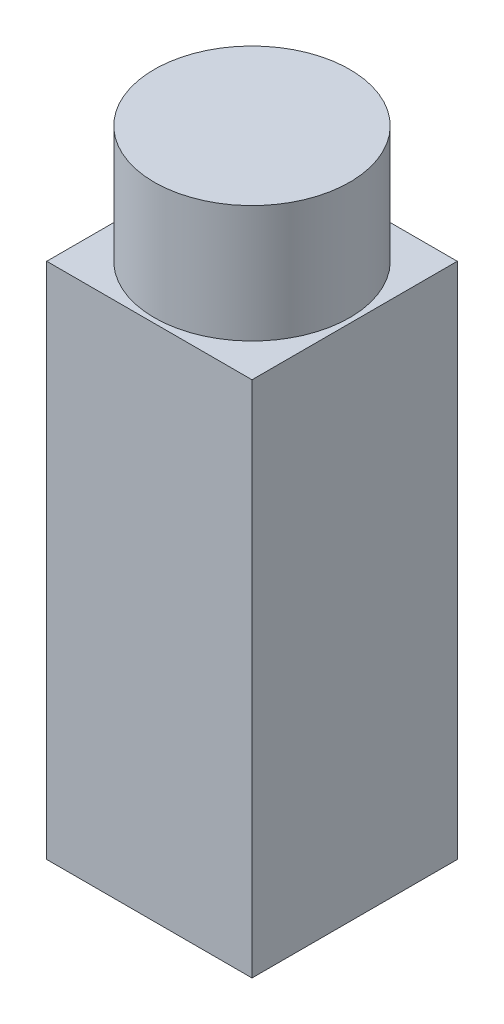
ISO-10303-21;
HEADER;
FILE_DESCRIPTION(('STEP AP214'),'2;1');
FILE_NAME('part.step','',(''),(''),'','','');
FILE_SCHEMA(('AUTOMOTIVE_DESIGN { 1 0 10303 214 1 1 1 1 }'));
ENDSEC;
DATA;
#1=APPLICATION_CONTEXT('core data for automotive mechanical design processes');
#2=APPLICATION_PROTOCOL_DEFINITION('international standard','automotive_design',2000,#1);
#3=PRODUCT_CONTEXT('',#1,'mechanical');
#4=PRODUCT('Part','Part','',(#3));
#5=PRODUCT_RELATED_PRODUCT_CATEGORY('part','',(#4));
#6=PRODUCT_DEFINITION_FORMATION('','',#4);
#7=PRODUCT_DEFINITION_CONTEXT('part definition',#1,'design');
#8=PRODUCT_DEFINITION('design','',#6,#7);
#9=PRODUCT_DEFINITION_SHAPE('','',#8);
#10=(LENGTH_UNIT() NAMED_UNIT(*) SI_UNIT(.MILLI.,.METRE.));
#11=(NAMED_UNIT(*) PLANE_ANGLE_UNIT() SI_UNIT($,.RADIAN.));
#12=(NAMED_UNIT(*) SI_UNIT($,.STERADIAN.) SOLID_ANGLE_UNIT());
#13=UNCERTAINTY_MEASURE_WITH_UNIT(LENGTH_MEASURE(1.E-05),#10,'distance_accuracy_value','');
#14=(GEOMETRIC_REPRESENTATION_CONTEXT(3) GLOBAL_UNCERTAINTY_ASSIGNED_CONTEXT((#13)) GLOBAL_UNIT_ASSIGNED_CONTEXT((#10,
#11,#12)) REPRESENTATION_CONTEXT('',''));
#15=CARTESIAN_POINT('',(0.,0.,0.));
#16=DIRECTION('',(0.,0.,1.));
#17=DIRECTION('',(1.,0.,0.));
#18=AXIS2_PLACEMENT_3D('',#15,#16,#17);
#19=CARTESIAN_POINT('',(-2.,26.5,-2.));
#20=DIRECTION('',(1.,0.,0.));
#21=DIRECTION('',(0.,0.,-1.));
#22=AXIS2_PLACEMENT_3D('',#19,#20,#21);
#23=PLANE('',#22);
#24=DIRECTION('',(0.,0.,1.));
#25=VECTOR('',#24,1.);
#26=CARTESIAN_POINT('',(-2.,0.,-2.));
#27=LINE('',#26,#25);
#28=CARTESIAN_POINT('',(-2.,0.,-2.));
#29=VERTEX_POINT('',#28);
#30=CARTESIAN_POINT('',(-2.,0.,8.5));
#31=VERTEX_POINT('',#30);
#32=EDGE_CURVE('E168',#29,#31,#27,.T.);
#33=ORIENTED_EDGE('',*,*,#32,.T.);
#34=DIRECTION('',(0.,-1.,0.));
#35=VECTOR('',#34,1.);
#36=CARTESIAN_POINT('',(-2.,26.5,8.5));
#37=LINE('',#36,#35);
#38=CARTESIAN_POINT('',(-2.,26.5,8.5));
#39=VERTEX_POINT('',#38);
#40=EDGE_CURVE('E48',#39,#31,#37,.T.);
#41=ORIENTED_EDGE('',*,*,#40,.F.);
#42=DIRECTION('',(0.,0.,1.));
#43=VECTOR('',#42,1.);
#44=CARTESIAN_POINT('',(-2.,26.5,-2.));
#45=LINE('',#44,#43);
#46=CARTESIAN_POINT('',(-2.,26.5,-2.));
#47=VERTEX_POINT('',#46);
#48=EDGE_CURVE('E174',#47,#39,#45,.T.);
#49=ORIENTED_EDGE('',*,*,#48,.F.);
#50=DIRECTION('',(0.,-1.,0.));
#51=VECTOR('',#50,1.);
#52=CARTESIAN_POINT('',(-2.,26.5,-2.));
#53=LINE('',#52,#51);
#54=EDGE_CURVE('E184',#47,#29,#53,.T.);
#55=ORIENTED_EDGE('',*,*,#54,.T.);
#56=EDGE_LOOP('',(#33,#41,#49,#55));
#57=FACE_BOUND('',#56,.T.);
#58=ADVANCED_FACE('F45',(#57),#23,.F.);
#59=CARTESIAN_POINT('',(-2.,26.5,8.5));
#60=DIRECTION('',(0.,0.,-1.));
#61=DIRECTION('',(-1.,0.,0.));
#62=AXIS2_PLACEMENT_3D('',#59,#60,#61);
#63=PLANE('',#62);
#64=DIRECTION('',(1.,0.,0.));
#65=VECTOR('',#64,1.);
#66=CARTESIAN_POINT('',(-2.,0.,8.5));
#67=LINE('',#66,#65);
#68=CARTESIAN_POINT('',(8.5,0.,8.5));
#69=VERTEX_POINT('',#68);
#70=EDGE_CURVE('E188',#31,#69,#67,.T.);
#71=ORIENTED_EDGE('',*,*,#70,.T.);
#72=DIRECTION('',(0.,-1.,0.));
#73=VECTOR('',#72,1.);
#74=CARTESIAN_POINT('',(8.5,26.5,8.5));
#75=LINE('',#74,#73);
#76=CARTESIAN_POINT('',(8.5,26.5,8.5));
#77=VERTEX_POINT('',#76);
#78=EDGE_CURVE('E200',#77,#69,#75,.T.);
#79=ORIENTED_EDGE('',*,*,#78,.F.);
#80=DIRECTION('',(1.,0.,0.));
#81=VECTOR('',#80,1.);
#82=CARTESIAN_POINT('',(-2.,26.5,8.5));
#83=LINE('',#82,#81);
#84=EDGE_CURVE('E99',#39,#77,#83,.T.);
#85=ORIENTED_EDGE('',*,*,#84,.F.);
#86=ORIENTED_EDGE('',*,*,#40,.T.);
#87=EDGE_LOOP('',(#71,#79,#85,#86));
#88=FACE_BOUND('',#87,.T.);
#89=ADVANCED_FACE('F208',(#88),#63,.F.);
#90=CARTESIAN_POINT('',(8.5,26.5,-2.));
#91=DIRECTION('',(-1.,0.,0.));
#92=DIRECTION('',(0.,0.,1.));
#93=AXIS2_PLACEMENT_3D('',#90,#91,#92);
#94=PLANE('',#93);
#95=DIRECTION('',(0.,0.,-1.));
#96=VECTOR('',#95,1.);
#97=CARTESIAN_POINT('',(8.5,0.,-2.));
#98=LINE('',#97,#96);
#99=CARTESIAN_POINT('',(8.5,0.,-2.));
#100=VERTEX_POINT('',#99);
#101=EDGE_CURVE('E191',#69,#100,#98,.T.);
#102=ORIENTED_EDGE('',*,*,#101,.T.);
#103=DIRECTION('',(0.,-1.,0.));
#104=VECTOR('',#103,1.);
#105=CARTESIAN_POINT('',(8.5,26.5,-2.));
#106=LINE('',#105,#104);
#107=CARTESIAN_POINT('',(8.5,26.5,-2.));
#108=VERTEX_POINT('',#107);
#109=EDGE_CURVE('E198',#108,#100,#106,.T.);
#110=ORIENTED_EDGE('',*,*,#109,.F.);
#111=DIRECTION('',(0.,0.,-1.));
#112=VECTOR('',#111,1.);
#113=CARTESIAN_POINT('',(8.5,26.5,-2.));
#114=LINE('',#113,#112);
#115=EDGE_CURVE('E179',#77,#108,#114,.T.);
#116=ORIENTED_EDGE('',*,*,#115,.F.);
#117=ORIENTED_EDGE('',*,*,#78,.T.);
#118=EDGE_LOOP('',(#102,#110,#116,#117));
#119=FACE_BOUND('',#118,.T.);
#120=ADVANCED_FACE('F215',(#119),#94,.F.);
#121=CARTESIAN_POINT('',(-2.,26.5,-2.));
#122=DIRECTION('',(0.,0.,1.));
#123=DIRECTION('',(1.,0.,0.));
#124=AXIS2_PLACEMENT_3D('',#121,#122,#123);
#125=PLANE('',#124);
#126=DIRECTION('',(-1.,0.,0.));
#127=VECTOR('',#126,1.);
#128=CARTESIAN_POINT('',(-2.,0.,-2.));
#129=LINE('',#128,#127);
#130=EDGE_CURVE('E91',#100,#29,#129,.T.);
#131=ORIENTED_EDGE('',*,*,#130,.T.);
#132=ORIENTED_EDGE('',*,*,#54,.F.);
#133=DIRECTION('',(-1.,0.,0.));
#134=VECTOR('',#133,1.);
#135=CARTESIAN_POINT('',(-2.,26.5,-2.));
#136=LINE('',#135,#134);
#137=EDGE_CURVE('E70',#108,#47,#136,.T.);
#138=ORIENTED_EDGE('',*,*,#137,.F.);
#139=ORIENTED_EDGE('',*,*,#109,.T.);
#140=EDGE_LOOP('',(#131,#132,#138,#139));
#141=FACE_BOUND('',#140,.T.);
#142=ADVANCED_FACE('F216',(#141),#125,.F.);
#143=CARTESIAN_POINT('',(0.,26.5,0.));
#144=DIRECTION('',(0.,1.,0.));
#145=DIRECTION('',(0.,0.,1.));
#146=AXIS2_PLACEMENT_3D('',#143,#144,#145);
#147=PLANE('',#146);
#148=CARTESIAN_POINT('',(3.25,26.5,3.25));
#149=DIRECTION('',(0.,1.,0.));
#150=DIRECTION('',(0.,0.,1.));
#151=AXIS2_PLACEMENT_3D('',#148,#149,#150);
#152=CIRCLE('',#151,5.);
#153=CARTESIAN_POINT('',(3.25,26.5,8.25));
#154=VERTEX_POINT('',#153);
#155=EDGE_CURVE('E11',#154,#154,#152,.T.);
#156=ORIENTED_EDGE('',*,*,#155,.F.);
#157=EDGE_LOOP('',(#156));
#158=FACE_BOUND('',#157,.T.);
#159=ORIENTED_EDGE('',*,*,#48,.T.);
#160=ORIENTED_EDGE('',*,*,#84,.T.);
#161=ORIENTED_EDGE('',*,*,#115,.T.);
#162=ORIENTED_EDGE('',*,*,#137,.T.);
#163=EDGE_LOOP('',(#159,#160,#161,#162));
#164=FACE_BOUND('',#163,.T.);
#165=ADVANCED_FACE('F217',(#158,#164),#147,.T.);
#166=CARTESIAN_POINT('',(0.,0.,0.));
#167=DIRECTION('',(0.,1.,0.));
#168=DIRECTION('',(0.,0.,1.));
#169=AXIS2_PLACEMENT_3D('',#166,#167,#168);
#170=PLANE('',#169);
#171=DIRECTION('',(1.,0.,0.));
#172=VECTOR('',#171,1.);
#173=CARTESIAN_POINT('',(0.,0.,0.));
#174=LINE('',#173,#172);
#175=CARTESIAN_POINT('',(0.,0.,0.));
#176=VERTEX_POINT('',#175);
#177=CARTESIAN_POINT('',(6.5,0.,0.));
#178=VERTEX_POINT('',#177);
#179=EDGE_CURVE('E158',#176,#178,#174,.T.);
#180=ORIENTED_EDGE('',*,*,#179,.F.);
#181=DIRECTION('',(0.,0.,-1.));
#182=VECTOR('',#181,1.);
#183=CARTESIAN_POINT('',(0.,0.,6.5));
#184=LINE('',#183,#182);
#185=CARTESIAN_POINT('',(0.,0.,6.5));
#186=VERTEX_POINT('',#185);
#187=EDGE_CURVE('E61',#186,#176,#184,.T.);
#188=ORIENTED_EDGE('',*,*,#187,.F.);
#189=DIRECTION('',(-1.,0.,0.));
#190=VECTOR('',#189,1.);
#191=CARTESIAN_POINT('',(0.,0.,6.5));
#192=LINE('',#191,#190);
#193=CARTESIAN_POINT('',(6.5,0.,6.5));
#194=VERTEX_POINT('',#193);
#195=EDGE_CURVE('E144',#194,#186,#192,.T.);
#196=ORIENTED_EDGE('',*,*,#195,.F.);
#197=DIRECTION('',(0.,0.,1.));
#198=VECTOR('',#197,1.);
#199=CARTESIAN_POINT('',(6.5,0.,6.5));
#200=LINE('',#199,#198);
#201=EDGE_CURVE('E148',#178,#194,#200,.T.);
#202=ORIENTED_EDGE('',*,*,#201,.F.);
#203=EDGE_LOOP('',(#180,#188,#196,#202));
#204=FACE_BOUND('',#203,.T.);
#205=ORIENTED_EDGE('',*,*,#32,.F.);
#206=ORIENTED_EDGE('',*,*,#130,.F.);
#207=ORIENTED_EDGE('',*,*,#101,.F.);
#208=ORIENTED_EDGE('',*,*,#70,.F.);
#209=EDGE_LOOP('',(#205,#206,#207,#208));
#210=FACE_BOUND('',#209,.T.);
#211=ADVANCED_FACE('F213',(#204,#210),#170,.F.);
#212=CARTESIAN_POINT('',(0.,3.,6.5));
#213=DIRECTION('',(-1.,0.,0.));
#214=DIRECTION('',(0.,0.,1.));
#215=AXIS2_PLACEMENT_3D('',#212,#213,#214);
#216=PLANE('',#215);
#217=ORIENTED_EDGE('',*,*,#187,.T.);
#218=DIRECTION('',(0.,-1.,0.));
#219=VECTOR('',#218,1.);
#220=CARTESIAN_POINT('',(0.,3.,0.));
#221=LINE('',#220,#219);
#222=CARTESIAN_POINT('',(0.,3.,0.));
#223=VERTEX_POINT('',#222);
#224=EDGE_CURVE('E119',#223,#176,#221,.T.);
#225=ORIENTED_EDGE('',*,*,#224,.F.);
#226=DIRECTION('',(0.,0.,-1.));
#227=VECTOR('',#226,1.);
#228=CARTESIAN_POINT('',(0.,3.,6.5));
#229=LINE('',#228,#227);
#230=CARTESIAN_POINT('',(0.,3.,6.5));
#231=VERTEX_POINT('',#230);
#232=EDGE_CURVE('E123',#231,#223,#229,.T.);
#233=ORIENTED_EDGE('',*,*,#232,.F.);
#234=DIRECTION('',(0.,-1.,0.));
#235=VECTOR('',#234,1.);
#236=CARTESIAN_POINT('',(0.,3.,6.5));
#237=LINE('',#236,#235);
#238=EDGE_CURVE('E165',#231,#186,#237,.T.);
#239=ORIENTED_EDGE('',*,*,#238,.T.);
#240=EDGE_LOOP('',(#217,#225,#233,#239));
#241=FACE_BOUND('',#240,.T.);
#242=ADVANCED_FACE('F121',(#241),#216,.F.);
#243=CARTESIAN_POINT('',(0.,3.,6.5));
#244=DIRECTION('',(0.,0.,1.));
#245=DIRECTION('',(1.,0.,0.));
#246=AXIS2_PLACEMENT_3D('',#243,#244,#245);
#247=PLANE('',#246);
#248=ORIENTED_EDGE('',*,*,#195,.T.);
#249=ORIENTED_EDGE('',*,*,#238,.F.);
#250=DIRECTION('',(-1.,0.,0.));
#251=VECTOR('',#250,1.);
#252=CARTESIAN_POINT('',(0.,3.,6.5));
#253=LINE('',#252,#251);
#254=CARTESIAN_POINT('',(6.5,3.,6.5));
#255=VERTEX_POINT('',#254);
#256=EDGE_CURVE('E130',#255,#231,#253,.T.);
#257=ORIENTED_EDGE('',*,*,#256,.F.);
#258=DIRECTION('',(0.,-1.,0.));
#259=VECTOR('',#258,1.);
#260=CARTESIAN_POINT('',(6.5,3.,6.5));
#261=LINE('',#260,#259);
#262=EDGE_CURVE('E169',#255,#194,#261,.T.);
#263=ORIENTED_EDGE('',*,*,#262,.T.);
#264=EDGE_LOOP('',(#248,#249,#257,#263));
#265=FACE_BOUND('',#264,.T.);
#266=ADVANCED_FACE('F259',(#265),#247,.F.);
#267=CARTESIAN_POINT('',(6.5,3.,6.5));
#268=DIRECTION('',(1.,0.,0.));
#269=DIRECTION('',(0.,0.,-1.));
#270=AXIS2_PLACEMENT_3D('',#267,#268,#269);
#271=PLANE('',#270);
#272=ORIENTED_EDGE('',*,*,#201,.T.);
#273=ORIENTED_EDGE('',*,*,#262,.F.);
#274=DIRECTION('',(0.,0.,1.));
#275=VECTOR('',#274,1.);
#276=CARTESIAN_POINT('',(6.5,3.,6.5));
#277=LINE('',#276,#275);
#278=CARTESIAN_POINT('',(6.5,3.,0.));
#279=VERTEX_POINT('',#278);
#280=EDGE_CURVE('E139',#279,#255,#277,.T.);
#281=ORIENTED_EDGE('',*,*,#280,.F.);
#282=DIRECTION('',(0.,-1.,0.));
#283=VECTOR('',#282,1.);
#284=CARTESIAN_POINT('',(6.5,3.,0.));
#285=LINE('',#284,#283);
#286=EDGE_CURVE('E129',#279,#178,#285,.T.);
#287=ORIENTED_EDGE('',*,*,#286,.T.);
#288=EDGE_LOOP('',(#272,#273,#281,#287));
#289=FACE_BOUND('',#288,.T.);
#290=ADVANCED_FACE('F266',(#289),#271,.F.);
#291=CARTESIAN_POINT('',(0.,3.,0.));
#292=DIRECTION('',(0.,0.,-1.));
#293=DIRECTION('',(-1.,0.,0.));
#294=AXIS2_PLACEMENT_3D('',#291,#292,#293);
#295=PLANE('',#294);
#296=ORIENTED_EDGE('',*,*,#179,.T.);
#297=ORIENTED_EDGE('',*,*,#286,.F.);
#298=DIRECTION('',(1.,0.,0.));
#299=VECTOR('',#298,1.);
#300=CARTESIAN_POINT('',(0.,3.,0.));
#301=LINE('',#300,#299);
#302=EDGE_CURVE('E133',#223,#279,#301,.T.);
#303=ORIENTED_EDGE('',*,*,#302,.F.);
#304=ORIENTED_EDGE('',*,*,#224,.T.);
#305=EDGE_LOOP('',(#296,#297,#303,#304));
#306=FACE_BOUND('',#305,.T.);
#307=ADVANCED_FACE('F134',(#306),#295,.F.);
#308=CARTESIAN_POINT('',(0.,3.,0.));
#309=DIRECTION('',(0.,-1.,0.));
#310=DIRECTION('',(0.,0.,-1.));
#311=AXIS2_PLACEMENT_3D('',#308,#309,#310);
#312=PLANE('',#311);
#313=ORIENTED_EDGE('',*,*,#232,.T.);
#314=ORIENTED_EDGE('',*,*,#302,.T.);
#315=ORIENTED_EDGE('',*,*,#280,.T.);
#316=ORIENTED_EDGE('',*,*,#256,.T.);
#317=EDGE_LOOP('',(#313,#314,#315,#316));
#318=FACE_BOUND('',#317,.T.);
#319=ADVANCED_FACE('F141',(#318),#312,.T.);
#320=CARTESIAN_POINT('',(3.25,32.5,3.25));
#321=DIRECTION('',(0.,-1.,0.));
#322=DIRECTION('',(0.,0.,-1.));
#323=AXIS2_PLACEMENT_3D('',#320,#321,#322);
#324=CYLINDRICAL_SURFACE('',#323,5.);
#325=CARTESIAN_POINT('',(3.25,32.5,3.25));
#326=DIRECTION('',(0.,1.,0.));
#327=DIRECTION('',(0.,0.,1.));
#328=AXIS2_PLACEMENT_3D('',#325,#326,#327);
#329=CIRCLE('',#328,5.);
#330=CARTESIAN_POINT('',(3.25,32.5,8.25));
#331=VERTEX_POINT('',#330);
#332=EDGE_CURVE('E159',#331,#331,#329,.T.);
#333=ORIENTED_EDGE('',*,*,#332,.F.);
#334=EDGE_LOOP('',(#333));
#335=FACE_BOUND('',#334,.T.);
#336=ORIENTED_EDGE('',*,*,#155,.T.);
#337=EDGE_LOOP('',(#336));
#338=FACE_BOUND('',#337,.T.);
#339=ADVANCED_FACE('F288',(#335,#338),#324,.T.);
#340=CARTESIAN_POINT('',(3.25,32.5,3.25));
#341=DIRECTION('',(0.,1.,0.));
#342=DIRECTION('',(0.,0.,1.));
#343=AXIS2_PLACEMENT_3D('',#340,#341,#342);
#344=PLANE('',#343);
#345=ORIENTED_EDGE('',*,*,#332,.T.);
#346=EDGE_LOOP('',(#345));
#347=FACE_BOUND('',#346,.T.);
#348=ADVANCED_FACE('F299',(#347),#344,.T.);
#349=CLOSED_SHELL('',(#58,#89,#120,#142,#165,#211,#242,#266,#290,#307,#319,#339,#348));
#350=MANIFOLD_SOLID_BREP('B2',#349);
#351=ADVANCED_BREP_SHAPE_REPRESENTATION('',(#18,#350),#14);
#352=SHAPE_DEFINITION_REPRESENTATION(#9,#351);
ENDSEC;
END-ISO-10303-21;
